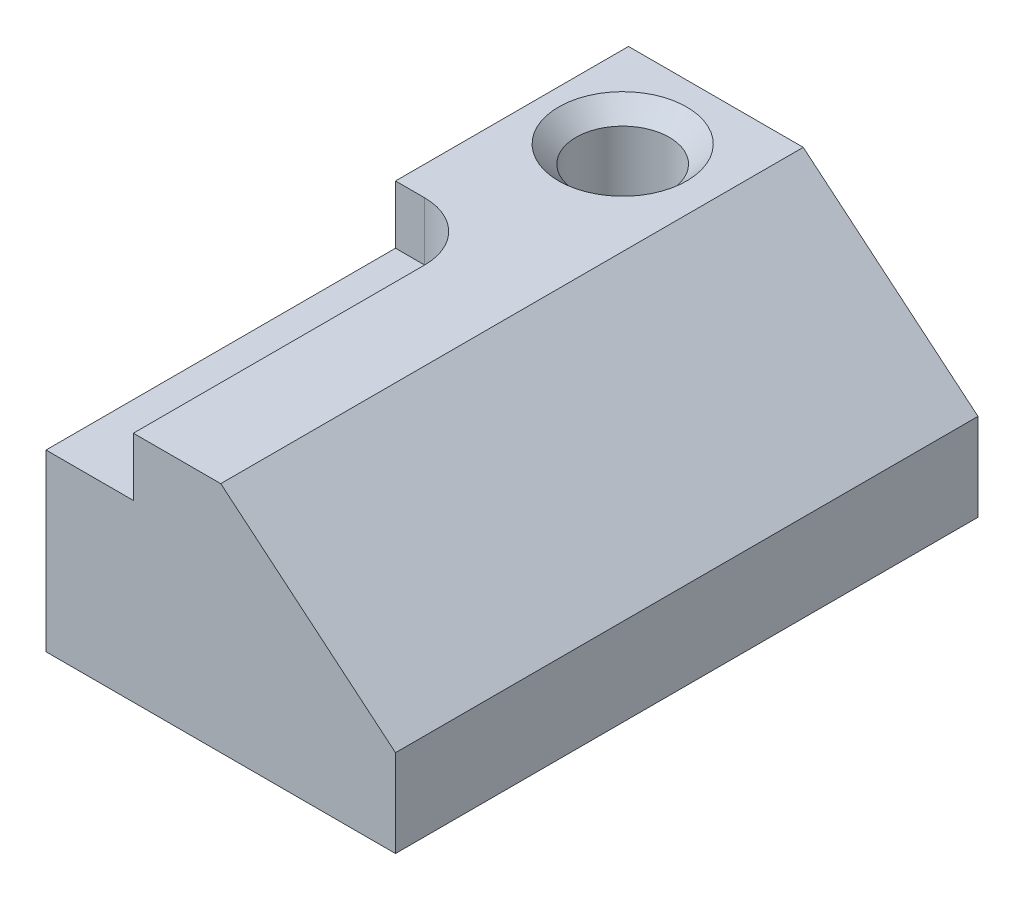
ISO-10303-21;
HEADER;
FILE_DESCRIPTION(('STEP AP214'),'2;1');
FILE_NAME('part.step','',(''),(''),'','','');
FILE_SCHEMA(('AUTOMOTIVE_DESIGN { 1 0 10303 214 1 1 1 1 }'));
ENDSEC;
DATA;
#1=APPLICATION_CONTEXT('core data for automotive mechanical design processes');
#2=APPLICATION_PROTOCOL_DEFINITION('international standard','automotive_design',2000,#1);
#3=PRODUCT_CONTEXT('',#1,'mechanical');
#4=PRODUCT('Part','Part','',(#3));
#5=PRODUCT_RELATED_PRODUCT_CATEGORY('part','',(#4));
#6=PRODUCT_DEFINITION_FORMATION('','',#4);
#7=PRODUCT_DEFINITION_CONTEXT('part definition',#1,'design');
#8=PRODUCT_DEFINITION('design','',#6,#7);
#9=PRODUCT_DEFINITION_SHAPE('','',#8);
#10=(LENGTH_UNIT() NAMED_UNIT(*) SI_UNIT(.MILLI.,.METRE.));
#11=(NAMED_UNIT(*) PLANE_ANGLE_UNIT() SI_UNIT($,.RADIAN.));
#12=(NAMED_UNIT(*) SI_UNIT($,.STERADIAN.) SOLID_ANGLE_UNIT());
#13=UNCERTAINTY_MEASURE_WITH_UNIT(LENGTH_MEASURE(1.E-05),#10,'distance_accuracy_value','');
#14=(GEOMETRIC_REPRESENTATION_CONTEXT(3) GLOBAL_UNCERTAINTY_ASSIGNED_CONTEXT((#13)) GLOBAL_UNIT_ASSIGNED_CONTEXT((#10,
#11,#12)) REPRESENTATION_CONTEXT('',''));
#15=CARTESIAN_POINT('',(0.,0.,0.));
#16=DIRECTION('',(0.,0.,1.));
#17=DIRECTION('',(1.,0.,0.));
#18=AXIS2_PLACEMENT_3D('',#15,#16,#17);
#19=CARTESIAN_POINT('',(76.2,0.,127.));
#20=DIRECTION('',(0.,1.,0.));
#21=DIRECTION('',(-1.,0.,0.));
#22=AXIS2_PLACEMENT_3D('',#19,#20,#21);
#23=PLANE('',#22);
#24=CARTESIAN_POINT('',(17.78,0.,19.05));
#25=DIRECTION('',(0.,1.,0.));
#26=DIRECTION('',(0.,0.,1.));
#27=AXIS2_PLACEMENT_3D('',#24,#25,#26);
#28=CIRCLE('',#27,10.16);
#29=CARTESIAN_POINT('',(17.78,0.,29.21));
#30=VERTEX_POINT('',#29);
#31=EDGE_CURVE('E176',#30,#30,#28,.T.);
#32=ORIENTED_EDGE('',*,*,#31,.T.);
#33=EDGE_LOOP('',(#32));
#34=FACE_BOUND('',#33,.T.);
#35=DIRECTION('',(1.,0.,0.));
#36=VECTOR('',#35,1.);
#37=CARTESIAN_POINT('',(76.2,0.,0.));
#38=LINE('',#37,#36);
#39=CARTESIAN_POINT('',(0.,0.,0.));
#40=VERTEX_POINT('',#39);
#41=CARTESIAN_POINT('',(76.2,0.,0.));
#42=VERTEX_POINT('',#41);
#43=EDGE_CURVE('E180',#40,#42,#38,.T.);
#44=ORIENTED_EDGE('',*,*,#43,.T.);
#45=DIRECTION('',(0.,0.,-1.));
#46=VECTOR('',#45,1.);
#47=CARTESIAN_POINT('',(76.2,0.,127.));
#48=LINE('',#47,#46);
#49=CARTESIAN_POINT('',(76.2,0.,127.));
#50=VERTEX_POINT('',#49);
#51=EDGE_CURVE('E132',#50,#42,#48,.T.);
#52=ORIENTED_EDGE('',*,*,#51,.F.);
#53=DIRECTION('',(1.,0.,0.));
#54=VECTOR('',#53,1.);
#55=CARTESIAN_POINT('',(76.2,0.,127.));
#56=LINE('',#55,#54);
#57=CARTESIAN_POINT('',(0.,0.,127.));
#58=VERTEX_POINT('',#57);
#59=EDGE_CURVE('E197',#58,#50,#56,.T.);
#60=ORIENTED_EDGE('',*,*,#59,.F.);
#61=DIRECTION('',(0.,0.,-1.));
#62=VECTOR('',#61,1.);
#63=CARTESIAN_POINT('',(0.,0.,127.));
#64=LINE('',#63,#62);
#65=EDGE_CURVE('E117',#58,#40,#64,.T.);
#66=ORIENTED_EDGE('',*,*,#65,.T.);
#67=EDGE_LOOP('',(#44,#52,#60,#66));
#68=FACE_BOUND('',#67,.T.);
#69=ADVANCED_FACE('F26',(#34,#68),#23,.F.);
#70=CARTESIAN_POINT('',(76.2,19.05,127.));
#71=DIRECTION('',(-1.,0.,0.));
#72=DIRECTION('',(0.,0.,1.));
#73=AXIS2_PLACEMENT_3D('',#70,#71,#72);
#74=PLANE('',#73);
#75=DIRECTION('',(0.,1.,0.));
#76=VECTOR('',#75,1.);
#77=CARTESIAN_POINT('',(76.2,19.05,0.));
#78=LINE('',#77,#76);
#79=CARTESIAN_POINT('',(76.2,19.05,0.));
#80=VERTEX_POINT('',#79);
#81=EDGE_CURVE('E185',#42,#80,#78,.T.);
#82=ORIENTED_EDGE('',*,*,#81,.T.);
#83=DIRECTION('',(0.,0.,-1.));
#84=VECTOR('',#83,1.);
#85=CARTESIAN_POINT('',(76.2,19.05,127.));
#86=LINE('',#85,#84);
#87=CARTESIAN_POINT('',(76.2,19.05,127.));
#88=VERTEX_POINT('',#87);
#89=EDGE_CURVE('E129',#88,#80,#86,.T.);
#90=ORIENTED_EDGE('',*,*,#89,.F.);
#91=DIRECTION('',(0.,1.,0.));
#92=VECTOR('',#91,1.);
#93=CARTESIAN_POINT('',(76.2,19.05,127.));
#94=LINE('',#93,#92);
#95=EDGE_CURVE('E119',#50,#88,#94,.T.);
#96=ORIENTED_EDGE('',*,*,#95,.F.);
#97=ORIENTED_EDGE('',*,*,#51,.T.);
#98=EDGE_LOOP('',(#82,#90,#96,#97));
#99=FACE_BOUND('',#98,.T.);
#100=ADVANCED_FACE('F164',(#99),#74,.F.);
#101=CARTESIAN_POINT('',(38.1,50.8,127.));
#102=DIRECTION('',(-0.64018439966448,-0.768221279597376,0.));
#103=DIRECTION('',(0.768221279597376,-0.64018439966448,0.));
#104=AXIS2_PLACEMENT_3D('',#101,#102,#103);
#105=PLANE('',#104);
#106=DIRECTION('',(-0.768221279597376,0.64018439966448,0.));
#107=VECTOR('',#106,1.);
#108=CARTESIAN_POINT('',(38.1,50.8,0.));
#109=LINE('',#108,#107);
#110=CARTESIAN_POINT('',(38.1,50.8,0.));
#111=VERTEX_POINT('',#110);
#112=EDGE_CURVE('E187',#80,#111,#109,.T.);
#113=ORIENTED_EDGE('',*,*,#112,.T.);
#114=DIRECTION('',(0.,0.,-1.));
#115=VECTOR('',#114,1.);
#116=CARTESIAN_POINT('',(38.1,50.8,127.));
#117=LINE('',#116,#115);
#118=CARTESIAN_POINT('',(38.1,50.8,127.));
#119=VERTEX_POINT('',#118);
#120=EDGE_CURVE('E127',#119,#111,#117,.T.);
#121=ORIENTED_EDGE('',*,*,#120,.F.);
#122=DIRECTION('',(-0.768221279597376,0.64018439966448,0.));
#123=VECTOR('',#122,1.);
#124=CARTESIAN_POINT('',(38.1,50.8,127.));
#125=LINE('',#124,#123);
#126=EDGE_CURVE('E113',#88,#119,#125,.T.);
#127=ORIENTED_EDGE('',*,*,#126,.F.);
#128=ORIENTED_EDGE('',*,*,#89,.T.);
#129=EDGE_LOOP('',(#113,#121,#127,#128));
#130=FACE_BOUND('',#129,.T.);
#131=ADVANCED_FACE('F171',(#130),#105,.F.);
#132=CARTESIAN_POINT('',(0.,50.8,127.));
#133=DIRECTION('',(0.,-1.,0.));
#134=DIRECTION('',(0.,0.,-1.));
#135=AXIS2_PLACEMENT_3D('',#132,#133,#134);
#136=PLANE('',#135);
#137=CARTESIAN_POINT('',(17.78,50.8,19.05));
#138=DIRECTION('',(0.,-1.,0.));
#139=DIRECTION('',(0.,0.,-1.));
#140=AXIS2_PLACEMENT_3D('',#137,#138,#139);
#141=CIRCLE('',#140,13.97);
#142=CARTESIAN_POINT('',(17.78,50.8,33.02));
#143=VERTEX_POINT('',#142);
#144=EDGE_CURVE('E138',#143,#143,#141,.T.);
#145=ORIENTED_EDGE('',*,*,#144,.T.);
#146=EDGE_LOOP('',(#145));
#147=FACE_BOUND('',#146,.T.);
#148=DIRECTION('',(0.,0.,-1.));
#149=VECTOR('',#148,1.);
#150=CARTESIAN_POINT('',(0.,50.8,127.));
#151=LINE('',#150,#149);
#152=CARTESIAN_POINT('',(0.,50.8,50.8));
#153=VERTEX_POINT('',#152);
#154=CARTESIAN_POINT('',(0.,50.8,0.));
#155=VERTEX_POINT('',#154);
#156=EDGE_CURVE('E125',#153,#155,#151,.T.);
#157=ORIENTED_EDGE('',*,*,#156,.F.);
#158=DIRECTION('',(-1.,0.,0.));
#159=VECTOR('',#158,1.);
#160=CARTESIAN_POINT('',(0.,50.8,50.8));
#161=LINE('',#160,#159);
#162=CARTESIAN_POINT('',(6.34999999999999,50.8,50.8));
#163=VERTEX_POINT('',#162);
#164=EDGE_CURVE('E109',#163,#153,#161,.T.);
#165=ORIENTED_EDGE('',*,*,#164,.F.);
#166=CARTESIAN_POINT('',(6.34999999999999,50.8,63.5));
#167=DIRECTION('',(0.,-1.,0.));
#168=DIRECTION('',(0.,0.,-1.));
#169=AXIS2_PLACEMENT_3D('',#166,#167,#168);
#170=CIRCLE('',#169,12.7);
#171=CARTESIAN_POINT('',(19.05,50.8,63.5));
#172=VERTEX_POINT('',#171);
#173=EDGE_CURVE('E11',#163,#172,#170,.T.);
#174=ORIENTED_EDGE('',*,*,#173,.T.);
#175=DIRECTION('',(0.,0.,-1.));
#176=VECTOR('',#175,1.);
#177=CARTESIAN_POINT('',(19.05,50.8,127.));
#178=LINE('',#177,#176);
#179=CARTESIAN_POINT('',(19.05,50.8,127.));
#180=VERTEX_POINT('',#179);
#181=EDGE_CURVE('E95',#180,#172,#178,.T.);
#182=ORIENTED_EDGE('',*,*,#181,.F.);
#183=DIRECTION('',(-1.,0.,0.));
#184=VECTOR('',#183,1.);
#185=CARTESIAN_POINT('',(0.,50.8,127.));
#186=LINE('',#185,#184);
#187=EDGE_CURVE('E108',#119,#180,#186,.T.);
#188=ORIENTED_EDGE('',*,*,#187,.F.);
#189=ORIENTED_EDGE('',*,*,#120,.T.);
#190=DIRECTION('',(-1.,0.,0.));
#191=VECTOR('',#190,1.);
#192=CARTESIAN_POINT('',(0.,50.8,0.));
#193=LINE('',#192,#191);
#194=EDGE_CURVE('E192',#111,#155,#193,.T.);
#195=ORIENTED_EDGE('',*,*,#194,.T.);
#196=EDGE_LOOP('',(#157,#165,#174,#182,#188,#189,#195));
#197=FACE_BOUND('',#196,.T.);
#198=ADVANCED_FACE('F106',(#147,#197),#136,.F.);
#199=CARTESIAN_POINT('',(0.,0.,127.));
#200=DIRECTION('',(1.,0.,0.));
#201=DIRECTION('',(0.,0.,-1.));
#202=AXIS2_PLACEMENT_3D('',#199,#200,#201);
#203=PLANE('',#202);
#204=DIRECTION('',(0.,0.,1.));
#205=VECTOR('',#204,1.);
#206=CARTESIAN_POINT('',(0.,38.1,127.));
#207=LINE('',#206,#205);
#208=CARTESIAN_POINT('',(0.,38.1,50.8));
#209=VERTEX_POINT('',#208);
#210=CARTESIAN_POINT('',(0.,38.1,127.));
#211=VERTEX_POINT('',#210);
#212=EDGE_CURVE('E207',#209,#211,#207,.T.);
#213=ORIENTED_EDGE('',*,*,#212,.F.);
#214=DIRECTION('',(0.,1.,0.));
#215=VECTOR('',#214,1.);
#216=CARTESIAN_POINT('',(0.,38.1,50.8));
#217=LINE('',#216,#215);
#218=EDGE_CURVE('E101',#209,#153,#217,.T.);
#219=ORIENTED_EDGE('',*,*,#218,.T.);
#220=ORIENTED_EDGE('',*,*,#156,.T.);
#221=DIRECTION('',(0.,-1.,0.));
#222=VECTOR('',#221,1.);
#223=CARTESIAN_POINT('',(0.,0.,0.));
#224=LINE('',#223,#222);
#225=EDGE_CURVE('E195',#155,#40,#224,.T.);
#226=ORIENTED_EDGE('',*,*,#225,.T.);
#227=ORIENTED_EDGE('',*,*,#65,.F.);
#228=DIRECTION('',(0.,-1.,0.));
#229=VECTOR('',#228,1.);
#230=CARTESIAN_POINT('',(0.,0.,127.));
#231=LINE('',#230,#229);
#232=EDGE_CURVE('E115',#211,#58,#231,.T.);
#233=ORIENTED_EDGE('',*,*,#232,.F.);
#234=EDGE_LOOP('',(#213,#219,#220,#226,#227,#233));
#235=FACE_BOUND('',#234,.T.);
#236=ADVANCED_FACE('F205',(#235),#203,.F.);
#237=CARTESIAN_POINT('',(76.2,0.,127.));
#238=DIRECTION('',(0.,0.,1.));
#239=DIRECTION('',(1.,0.,0.));
#240=AXIS2_PLACEMENT_3D('',#237,#238,#239);
#241=PLANE('',#240);
#242=DIRECTION('',(0.,1.,0.));
#243=VECTOR('',#242,1.);
#244=CARTESIAN_POINT('',(19.05,38.1,127.));
#245=LINE('',#244,#243);
#246=CARTESIAN_POINT('',(19.05,38.1,127.));
#247=VERTEX_POINT('',#246);
#248=EDGE_CURVE('E93',#247,#180,#245,.T.);
#249=ORIENTED_EDGE('',*,*,#248,.F.);
#250=DIRECTION('',(1.,0.,0.));
#251=VECTOR('',#250,1.);
#252=CARTESIAN_POINT('',(0.,38.1,127.));
#253=LINE('',#252,#251);
#254=EDGE_CURVE('E209',#211,#247,#253,.T.);
#255=ORIENTED_EDGE('',*,*,#254,.F.);
#256=ORIENTED_EDGE('',*,*,#232,.T.);
#257=ORIENTED_EDGE('',*,*,#59,.T.);
#258=ORIENTED_EDGE('',*,*,#95,.T.);
#259=ORIENTED_EDGE('',*,*,#126,.T.);
#260=ORIENTED_EDGE('',*,*,#187,.T.);
#261=EDGE_LOOP('',(#249,#255,#256,#257,#258,#259,#260));
#262=FACE_BOUND('',#261,.T.);
#263=ADVANCED_FACE('F111',(#262),#241,.T.);
#264=CARTESIAN_POINT('',(76.2,0.,0.));
#265=DIRECTION('',(0.,0.,1.));
#266=DIRECTION('',(1.,0.,0.));
#267=AXIS2_PLACEMENT_3D('',#264,#265,#266);
#268=PLANE('',#267);
#269=ORIENTED_EDGE('',*,*,#43,.F.);
#270=ORIENTED_EDGE('',*,*,#225,.F.);
#271=ORIENTED_EDGE('',*,*,#194,.F.);
#272=ORIENTED_EDGE('',*,*,#112,.F.);
#273=ORIENTED_EDGE('',*,*,#81,.F.);
#274=EDGE_LOOP('',(#269,#270,#271,#272,#273));
#275=FACE_BOUND('',#274,.T.);
#276=ADVANCED_FACE('F203',(#275),#268,.F.);
#277=CARTESIAN_POINT('',(17.78,0.,19.05));
#278=DIRECTION('',(0.,1.,0.));
#279=DIRECTION('',(0.,0.,1.));
#280=AXIS2_PLACEMENT_3D('',#277,#278,#279);
#281=CYLINDRICAL_SURFACE('',#280,10.16);
#282=CARTESIAN_POINT('',(17.78,46.9900000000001,19.05));
#283=DIRECTION('',(0.,-1.,0.));
#284=DIRECTION('',(0.,0.,-1.));
#285=AXIS2_PLACEMENT_3D('',#282,#283,#284);
#286=CIRCLE('',#285,10.16);
#287=CARTESIAN_POINT('',(17.78,46.9900000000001,29.21));
#288=VERTEX_POINT('',#287);
#289=EDGE_CURVE('E135',#288,#288,#286,.F.);
#290=ORIENTED_EDGE('',*,*,#289,.T.);
#291=EDGE_LOOP('',(#290));
#292=FACE_BOUND('',#291,.T.);
#293=ORIENTED_EDGE('',*,*,#31,.F.);
#294=EDGE_LOOP('',(#293));
#295=FACE_BOUND('',#294,.T.);
#296=ADVANCED_FACE('F236',(#292,#295),#281,.F.);
#297=CARTESIAN_POINT('',(17.78,46.9900000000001,19.05));
#298=DIRECTION('',(0.,1.,0.));
#299=DIRECTION('',(0.,0.,1.));
#300=AXIS2_PLACEMENT_3D('',#297,#298,#299);
#301=CONICAL_SURFACE('',#300,10.16,0.785398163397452);
#302=CARTESIAN_POINT('',(17.78,50.8,33.02));
#303=CARTESIAN_POINT('',(17.78,50.7603125,32.9803125));
#304=CARTESIAN_POINT('',(17.78,50.720625,32.940625));
#305=CARTESIAN_POINT('',(17.78,50.64125,32.86125));
#306=CARTESIAN_POINT('',(17.78,50.6015625,32.8215625));
#307=CARTESIAN_POINT('',(17.78,50.5221875,32.7421875));
#308=CARTESIAN_POINT('',(17.78,50.4825,32.7025));
#309=CARTESIAN_POINT('',(17.78,50.403125,32.623125));
#310=CARTESIAN_POINT('',(17.78,50.3634375,32.5834375));
#311=CARTESIAN_POINT('',(17.78,50.2840625,32.5040625));
#312=CARTESIAN_POINT('',(17.78,50.244375,32.464375));
#313=CARTESIAN_POINT('',(17.78,50.165,32.385));
#314=CARTESIAN_POINT('',(17.78,50.1253125,32.3453125));
#315=CARTESIAN_POINT('',(17.78,50.0459375,32.2659375));
#316=CARTESIAN_POINT('',(17.78,50.00625,32.22625));
#317=CARTESIAN_POINT('',(17.78,49.926875,32.146875));
#318=CARTESIAN_POINT('',(17.78,49.8871875,32.1071875));
#319=CARTESIAN_POINT('',(17.78,49.8078125,32.0278125));
#320=CARTESIAN_POINT('',(17.78,49.768125,31.988125));
#321=CARTESIAN_POINT('',(17.78,49.68875,31.90875));
#322=CARTESIAN_POINT('',(17.78,49.6490625,31.8690625));
#323=CARTESIAN_POINT('',(17.78,49.5696875,31.7896875));
#324=CARTESIAN_POINT('',(17.78,49.53,31.75));
#325=CARTESIAN_POINT('',(17.78,49.450625,31.670625));
#326=CARTESIAN_POINT('',(17.78,49.4109375,31.6309375));
#327=CARTESIAN_POINT('',(17.78,49.3315625,31.5515625));
#328=CARTESIAN_POINT('',(17.78,49.291875,31.511875));
#329=CARTESIAN_POINT('',(17.78,49.2125,31.4325));
#330=CARTESIAN_POINT('',(17.78,49.1728125,31.3928125));
#331=CARTESIAN_POINT('',(17.78,49.0934375,31.3134375));
#332=CARTESIAN_POINT('',(17.78,49.05375,31.27375));
#333=CARTESIAN_POINT('',(17.78,48.974375,31.194375));
#334=CARTESIAN_POINT('',(17.78,48.9346875,31.1546875));
#335=CARTESIAN_POINT('',(17.78,48.8553125,31.0753125));
#336=CARTESIAN_POINT('',(17.78,48.815625,31.035625));
#337=CARTESIAN_POINT('',(17.78,48.73625,30.95625));
#338=CARTESIAN_POINT('',(17.78,48.6965625,30.9165625));
#339=CARTESIAN_POINT('',(17.78,48.6171875,30.8371875));
#340=CARTESIAN_POINT('',(17.78,48.5775,30.7975));
#341=CARTESIAN_POINT('',(17.78,48.498125,30.718125));
#342=CARTESIAN_POINT('',(17.78,48.4584375,30.6784375));
#343=CARTESIAN_POINT('',(17.78,48.3790625,30.5990625));
#344=CARTESIAN_POINT('',(17.78,48.339375,30.559375));
#345=CARTESIAN_POINT('',(17.78,48.26,30.48));
#346=CARTESIAN_POINT('',(17.78,48.2203125,30.4403125));
#347=CARTESIAN_POINT('',(17.78,48.1409375,30.3609375));
#348=CARTESIAN_POINT('',(17.78,48.1012500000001,30.32125));
#349=CARTESIAN_POINT('',(17.78,48.021875,30.241875));
#350=CARTESIAN_POINT('',(17.78,47.9821875,30.2021875));
#351=CARTESIAN_POINT('',(17.78,47.9028125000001,30.1228125));
#352=CARTESIAN_POINT('',(17.78,47.863125,30.083125));
#353=CARTESIAN_POINT('',(17.78,47.78375,30.00375));
#354=CARTESIAN_POINT('',(17.78,47.7440625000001,29.9640625));
#355=CARTESIAN_POINT('',(17.78,47.6646875,29.8846875));
#356=CARTESIAN_POINT('',(17.78,47.625,29.845));
#357=CARTESIAN_POINT('',(17.78,47.5456250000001,29.765625));
#358=CARTESIAN_POINT('',(17.78,47.5059375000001,29.7259375));
#359=CARTESIAN_POINT('',(17.78,47.4265625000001,29.6465625));
#360=CARTESIAN_POINT('',(17.78,47.3868750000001,29.606875));
#361=CARTESIAN_POINT('',(17.78,47.3075000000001,29.5275));
#362=CARTESIAN_POINT('',(17.78,47.2678125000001,29.4878125));
#363=CARTESIAN_POINT('',(17.78,47.1884375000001,29.4084375));
#364=CARTESIAN_POINT('',(17.78,47.1487500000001,29.36875));
#365=CARTESIAN_POINT('',(17.78,47.0693750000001,29.289375));
#366=CARTESIAN_POINT('',(17.78,47.0296875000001,29.2496875));
#367=CARTESIAN_POINT('',(17.78,46.9900000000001,29.21));
#368=B_SPLINE_CURVE_WITH_KNOTS('',3,(#302,#303,#304,#305,#306,#307,#308,#309,#310,#311,#312,
#313,#314,#315,#316,#317,#318,#319,#320,#321,#322,#323,#324,#325,#326,#327,#328,#329,#330,#331,
#332,#333,#334,#335,#336,#337,#338,#339,#340,#341,#342,#343,#344,#345,#346,#347,#348,#349,#350,
#351,#352,#353,#354,#355,#356,#357,#358,#359,#360,#361,#362,#363,#364,#365,#366,#367),
.UNSPECIFIED.,.F.,.F.,(4,2,2,2,2,2,2,2,2,2,2,2,2,2,2,2,2,2,2,2,2,2,2,2,2,2,2,2,2,2,2,2,4),(0.,
0.168379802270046,0.336759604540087,0.505139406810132,0.673519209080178,0.841899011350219,
1.01027881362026,1.17865861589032,1.34703841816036,1.5154182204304,1.68379802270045,
1.85217782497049,2.02055762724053,2.18893742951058,2.35731723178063,2.52569703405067,
2.69407683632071,2.86245663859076,3.0308364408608,3.19921624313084,3.36759604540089,
3.53597584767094,3.70435564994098,3.87273545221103,4.04111525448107,4.20949505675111,
4.37787485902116,4.5462546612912,4.71463446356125,4.88301426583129,5.05139406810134,
5.21977387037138,5.38815367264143),.UNSPECIFIED.);
#369=EDGE_CURVE('BSEAM246',#143,#288,#368,.T.);
#370=ORIENTED_EDGE('',*,*,#144,.F.);
#371=ORIENTED_EDGE('',*,*,#289,.F.);
#372=ORIENTED_EDGE('',*,*,#369,.T.);
#373=ORIENTED_EDGE('',*,*,#369,.F.);
#374=EDGE_LOOP('',(#370,#372,#371,#373));
#375=FACE_BOUND('',#374,.T.);
#376=ADVANCED_FACE('F246',(#375),#301,.F.);
#377=CARTESIAN_POINT('',(0.,38.1,50.8));
#378=DIRECTION('',(0.,0.,-1.));
#379=DIRECTION('',(-1.,0.,0.));
#380=AXIS2_PLACEMENT_3D('',#377,#378,#379);
#381=PLANE('',#380);
#382=DIRECTION('',(-1.,0.,0.));
#383=VECTOR('',#382,1.);
#384=CARTESIAN_POINT('',(0.,38.1,50.8));
#385=LINE('',#384,#383);
#386=CARTESIAN_POINT('',(6.34999999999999,38.1,50.8));
#387=VERTEX_POINT('',#386);
#388=EDGE_CURVE('E102',#387,#209,#385,.T.);
#389=ORIENTED_EDGE('',*,*,#388,.F.);
#390=DIRECTION('',(0.,1.,0.));
#391=VECTOR('',#390,1.);
#392=CARTESIAN_POINT('',(6.34999999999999,50.8,50.8));
#393=LINE('',#392,#391);
#394=EDGE_CURVE('E141',#387,#163,#393,.T.);
#395=ORIENTED_EDGE('',*,*,#394,.T.);
#396=ORIENTED_EDGE('',*,*,#164,.T.);
#397=ORIENTED_EDGE('',*,*,#218,.F.);
#398=EDGE_LOOP('',(#389,#395,#396,#397));
#399=FACE_BOUND('',#398,.T.);
#400=ADVANCED_FACE('F152',(#399),#381,.F.);
#401=CARTESIAN_POINT('',(19.05,38.1,127.));
#402=DIRECTION('',(1.,0.,0.));
#403=DIRECTION('',(0.,0.,-1.));
#404=AXIS2_PLACEMENT_3D('',#401,#402,#403);
#405=PLANE('',#404);
#406=ORIENTED_EDGE('',*,*,#181,.T.);
#407=DIRECTION('',(0.,1.,0.));
#408=VECTOR('',#407,1.);
#409=CARTESIAN_POINT('',(19.05,38.1,63.5));
#410=LINE('',#409,#408);
#411=CARTESIAN_POINT('',(19.05,38.1,63.5));
#412=VERTEX_POINT('',#411);
#413=EDGE_CURVE('E40',#172,#412,#410,.F.);
#414=ORIENTED_EDGE('',*,*,#413,.T.);
#415=DIRECTION('',(0.,0.,-1.));
#416=VECTOR('',#415,1.);
#417=CARTESIAN_POINT('',(19.05,38.1,127.));
#418=LINE('',#417,#416);
#419=EDGE_CURVE('E96',#247,#412,#418,.T.);
#420=ORIENTED_EDGE('',*,*,#419,.F.);
#421=ORIENTED_EDGE('',*,*,#248,.T.);
#422=EDGE_LOOP('',(#406,#414,#420,#421));
#423=FACE_BOUND('',#422,.T.);
#424=ADVANCED_FACE('F94',(#423),#405,.F.);
#425=CARTESIAN_POINT('',(0.,38.1,50.8));
#426=DIRECTION('',(0.,-1.,0.));
#427=DIRECTION('',(0.,0.,-1.));
#428=AXIS2_PLACEMENT_3D('',#425,#426,#427);
#429=PLANE('',#428);
#430=ORIENTED_EDGE('',*,*,#419,.T.);
#431=CARTESIAN_POINT('',(6.34999999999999,38.1,63.5));
#432=DIRECTION('',(0.,-1.,0.));
#433=DIRECTION('',(0.,0.,-1.));
#434=AXIS2_PLACEMENT_3D('',#431,#432,#433);
#435=CIRCLE('',#434,12.7);
#436=EDGE_CURVE('E33',#412,#387,#435,.F.);
#437=ORIENTED_EDGE('',*,*,#436,.T.);
#438=ORIENTED_EDGE('',*,*,#388,.T.);
#439=ORIENTED_EDGE('',*,*,#212,.T.);
#440=ORIENTED_EDGE('',*,*,#254,.T.);
#441=EDGE_LOOP('',(#430,#437,#438,#439,#440));
#442=FACE_BOUND('',#441,.T.);
#443=ADVANCED_FACE('F147',(#442),#429,.F.);
#444=CARTESIAN_POINT('',(6.34999999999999,38.1,63.5));
#445=DIRECTION('',(0.,-1.,0.));
#446=DIRECTION('',(0.,0.,-1.));
#447=AXIS2_PLACEMENT_3D('',#444,#445,#446);
#448=CYLINDRICAL_SURFACE('',#447,12.7);
#449=ORIENTED_EDGE('',*,*,#436,.F.);
#450=ORIENTED_EDGE('',*,*,#413,.F.);
#451=ORIENTED_EDGE('',*,*,#173,.F.);
#452=ORIENTED_EDGE('',*,*,#394,.F.);
#453=EDGE_LOOP('',(#449,#450,#451,#452));
#454=FACE_BOUND('',#453,.T.);
#455=ADVANCED_FACE('F156',(#454),#448,.F.);
#456=CLOSED_SHELL('',(#69,#100,#131,#198,#236,#263,#276,#296,#376,#400,#424,#443,#455));
#457=MANIFOLD_SOLID_BREP('B2',#456);
#458=ADVANCED_BREP_SHAPE_REPRESENTATION('',(#18,#457),#14);
#459=SHAPE_DEFINITION_REPRESENTATION(#9,#458);
ENDSEC;
END-ISO-10303-21;
